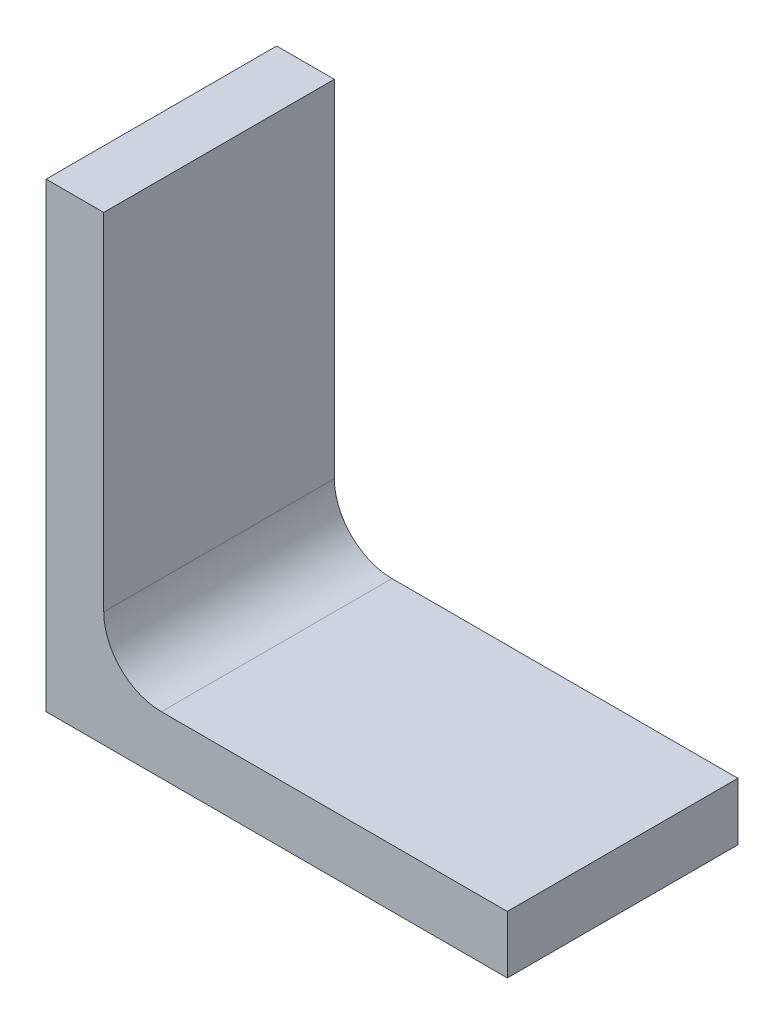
from build123d import *

# Parameters (mm, degrees)
BASEANGLESE_DEPTH = 12.7


with BuildPart() as part:
    # Sketch1 → BaseAnglese (new, symmetric)
    with BuildSketch(Plane.XY):
        with BuildLine():
            Line((0, 0), (0, 50.8))
            Line((0, 50.8), (6.35, 50.8))
            Line((6.35, 50.8), (6.35, 12.7))
            ThreePointArc((6.35, 12.7), (8.209871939, 8.209871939), (12.7, 6.35))
            Line((12.7, 6.35), (50.8, 6.35))
            Line((50.8, 6.35), (50.8, 0))
            Line((50.8, 0), (0, 0))
        make_face()
    extrude(amount=BASEANGLESE_DEPTH, both=True)


solid = part.part
